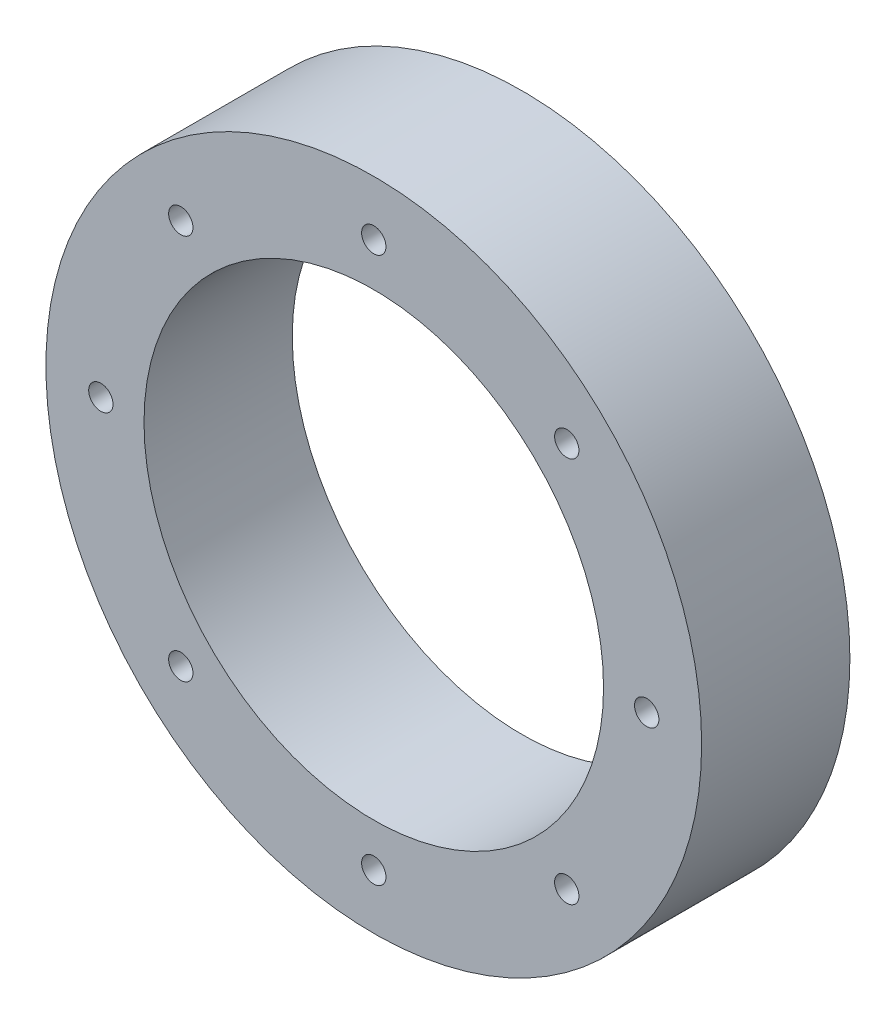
from build123d import *

# Parameters (mm, degrees)
SKETCH1_R           = 44.45
SKETCH1_R_2         = 31.15
SKETCH1_R_3         = 1.65
BOSS_EXTRUDE1_DEPTH = 10.05


with BuildPart() as part:
    # Sketch1 → Boss-Extrude1 (new, symmetric)
    with BuildSketch(Plane(origin=(0, 0, 0), x_dir=(0, 1, 0), z_dir=(0, 0, 1))):
        with Locations(Location((0, 0, 0), (0, 0, 270))):
            Circle(SKETCH1_R)
        with Locations(Location((0, 0, 0), (0, 0, 270))):
            Circle(SKETCH1_R_2, mode=Mode.SUBTRACT)
        with Locations(Location((37, 0, 0), (0, 0, 270))):
            Circle(SKETCH1_R_3, mode=Mode.SUBTRACT)
        with Locations(Location((26.162950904, -26.162950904, 0), (0, 0, 270))):
            Circle(SKETCH1_R_3, mode=Mode.SUBTRACT)
        with Locations(Location((0, -37, 0), (0, 0, 270))):
            Circle(SKETCH1_R_3, mode=Mode.SUBTRACT)
        with Locations(Location((-26.162950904, -26.162950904, 0), (0, 0, 270))):
            Circle(SKETCH1_R_3, mode=Mode.SUBTRACT)
        with Locations(Location((-37, 0, 0), (0, 0, 270))):
            Circle(SKETCH1_R_3, mode=Mode.SUBTRACT)
        with Locations(Location((-26.162950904, 26.162950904, 0), (0, 0, 270))):
            Circle(SKETCH1_R_3, mode=Mode.SUBTRACT)
        with Locations(Location((0, 37, 0), (0, 0, 270))):
            Circle(SKETCH1_R_3, mode=Mode.SUBTRACT)
        with Locations(Location((26.162950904, 26.162950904, 0), (0, 0, 270))):
            Circle(SKETCH1_R_3, mode=Mode.SUBTRACT)
    extrude(amount=BOSS_EXTRUDE1_DEPTH, both=True)


solid = part.part
